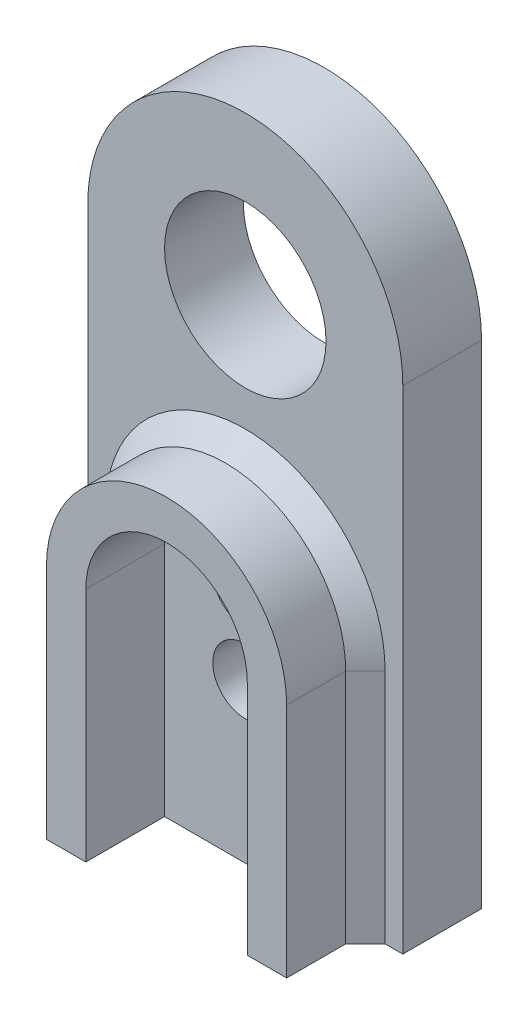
ISO-10303-21;
HEADER;
FILE_DESCRIPTION(('STEP AP214'),'2;1');
FILE_NAME('part.step','',(''),(''),'','','');
FILE_SCHEMA(('AUTOMOTIVE_DESIGN { 1 0 10303 214 1 1 1 1 }'));
ENDSEC;
DATA;
#1=APPLICATION_CONTEXT('core data for automotive mechanical design processes');
#2=APPLICATION_PROTOCOL_DEFINITION('international standard','automotive_design',2000,#1);
#3=PRODUCT_CONTEXT('',#1,'mechanical');
#4=PRODUCT('Part','Part','',(#3));
#5=PRODUCT_RELATED_PRODUCT_CATEGORY('part','',(#4));
#6=PRODUCT_DEFINITION_FORMATION('','',#4);
#7=PRODUCT_DEFINITION_CONTEXT('part definition',#1,'design');
#8=PRODUCT_DEFINITION('design','',#6,#7);
#9=PRODUCT_DEFINITION_SHAPE('','',#8);
#10=(LENGTH_UNIT() NAMED_UNIT(*) SI_UNIT(.MILLI.,.METRE.));
#11=(NAMED_UNIT(*) PLANE_ANGLE_UNIT() SI_UNIT($,.RADIAN.));
#12=(NAMED_UNIT(*) SI_UNIT($,.STERADIAN.) SOLID_ANGLE_UNIT());
#13=UNCERTAINTY_MEASURE_WITH_UNIT(LENGTH_MEASURE(1.E-05),#10,'distance_accuracy_value','');
#14=(GEOMETRIC_REPRESENTATION_CONTEXT(3) GLOBAL_UNCERTAINTY_ASSIGNED_CONTEXT((#13)) GLOBAL_UNIT_ASSIGNED_CONTEXT((#10,
#11,#12)) REPRESENTATION_CONTEXT('',''));
#15=CARTESIAN_POINT('',(0.,0.,0.));
#16=DIRECTION('',(0.,0.,1.));
#17=DIRECTION('',(1.,0.,0.));
#18=AXIS2_PLACEMENT_3D('',#15,#16,#17);
#19=CARTESIAN_POINT('',(0.,0.,4.));
#20=DIRECTION('',(0.,0.,1.));
#21=DIRECTION('',(1.,0.,0.));
#22=AXIS2_PLACEMENT_3D('',#19,#20,#21);
#23=PLANE('',#22);
#24=DIRECTION('',(-1.,0.,0.));
#25=VECTOR('',#24,1.);
#26=CARTESIAN_POINT('',(0.,-25.,4.));
#27=LINE('',#26,#25);
#28=CARTESIAN_POINT('',(-7.1,-25.,4.));
#29=VERTEX_POINT('',#28);
#30=CARTESIAN_POINT('',(-8.,-25.,4.));
#31=VERTEX_POINT('',#30);
#32=EDGE_CURVE('E210',#29,#31,#27,.T.);
#33=ORIENTED_EDGE('',*,*,#32,.F.);
#34=DIRECTION('',(0.,1.,0.));
#35=VECTOR('',#34,1.);
#36=CARTESIAN_POINT('',(-7.1,-13.,4.));
#37=LINE('',#36,#35);
#38=CARTESIAN_POINT('',(-7.1,-13.,4.));
#39=VERTEX_POINT('',#38);
#40=EDGE_CURVE('E249',#29,#39,#37,.T.);
#41=ORIENTED_EDGE('',*,*,#40,.T.);
#42=CARTESIAN_POINT('',(0.,-13.,4.));
#43=DIRECTION('',(0.,0.,1.));
#44=DIRECTION('',(1.,0.,0.));
#45=AXIS2_PLACEMENT_3D('',#42,#43,#44);
#46=CIRCLE('',#45,7.1);
#47=CARTESIAN_POINT('',(7.1,-13.,4.));
#48=VERTEX_POINT('',#47);
#49=EDGE_CURVE('E245',#39,#48,#46,.F.);
#50=ORIENTED_EDGE('',*,*,#49,.T.);
#51=DIRECTION('',(0.,-1.,0.));
#52=VECTOR('',#51,1.);
#53=CARTESIAN_POINT('',(7.1,-25.,4.));
#54=LINE('',#53,#52);
#55=CARTESIAN_POINT('',(7.1,-25.,4.));
#56=VERTEX_POINT('',#55);
#57=EDGE_CURVE('E247',#48,#56,#54,.T.);
#58=ORIENTED_EDGE('',*,*,#57,.T.);
#59=CARTESIAN_POINT('',(8.,-25.,4.));
#60=VERTEX_POINT('',#59);
#61=EDGE_CURVE('E211',#60,#56,#27,.T.);
#62=ORIENTED_EDGE('',*,*,#61,.F.);
#63=DIRECTION('',(0.,1.,0.));
#64=VECTOR('',#63,1.);
#65=CARTESIAN_POINT('',(8.,0.,4.));
#66=LINE('',#65,#64);
#67=CARTESIAN_POINT('',(8.,0.,4.));
#68=VERTEX_POINT('',#67);
#69=EDGE_CURVE('E228',#60,#68,#66,.T.);
#70=ORIENTED_EDGE('',*,*,#69,.T.);
#71=CARTESIAN_POINT('',(0.,0.,4.));
#72=DIRECTION('',(0.,0.,1.));
#73=DIRECTION('',(1.,0.,0.));
#74=AXIS2_PLACEMENT_3D('',#71,#72,#73);
#75=CIRCLE('',#74,8.);
#76=CARTESIAN_POINT('',(-8.,0.,4.));
#77=VERTEX_POINT('',#76);
#78=EDGE_CURVE('E221',#68,#77,#75,.T.);
#79=ORIENTED_EDGE('',*,*,#78,.T.);
#80=DIRECTION('',(0.,-1.,0.));
#81=VECTOR('',#80,1.);
#82=CARTESIAN_POINT('',(-8.,0.,4.));
#83=LINE('',#82,#81);
#84=EDGE_CURVE('E224',#77,#31,#83,.T.);
#85=ORIENTED_EDGE('',*,*,#84,.T.);
#86=EDGE_LOOP('',(#33,#41,#50,#58,#62,#70,#79,#85));
#87=FACE_BOUND('',#86,.T.);
#88=CARTESIAN_POINT('',(0.,0.,4.));
#89=DIRECTION('',(0.,0.,1.));
#90=DIRECTION('',(1.,0.,0.));
#91=AXIS2_PLACEMENT_3D('',#88,#89,#90);
#92=CIRCLE('',#91,4.1);
#93=CARTESIAN_POINT('',(4.1,0.,4.));
#94=VERTEX_POINT('',#93);
#95=EDGE_CURVE('E215',#94,#94,#92,.T.);
#96=ORIENTED_EDGE('',*,*,#95,.F.);
#97=EDGE_LOOP('',(#96));
#98=FACE_BOUND('',#97,.T.);
#99=ADVANCED_FACE('F37',(#87,#98),#23,.T.);
#100=CARTESIAN_POINT('',(0.,-13.0000000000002,4.));
#101=DIRECTION('',(0.,0.,1.));
#102=DIRECTION('',(1.,0.,0.));
#103=AXIS2_PLACEMENT_3D('',#100,#101,#102);
#104=CIRCLE('',#103,1.65);
#105=CARTESIAN_POINT('',(1.65,-13.0000000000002,4.));
#106=VERTEX_POINT('',#105);
#107=EDGE_CURVE('E171',#106,#106,#104,.T.);
#108=ORIENTED_EDGE('',*,*,#107,.F.);
#109=EDGE_LOOP('',(#108));
#110=FACE_BOUND('',#109,.T.);
#111=CARTESIAN_POINT('',(0.,-17.0000000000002,4.));
#112=DIRECTION('',(0.,0.,1.));
#113=DIRECTION('',(1.,0.,0.));
#114=AXIS2_PLACEMENT_3D('',#111,#112,#113);
#115=CIRCLE('',#114,1.65);
#116=CARTESIAN_POINT('',(1.65,-17.0000000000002,4.));
#117=VERTEX_POINT('',#116);
#118=EDGE_CURVE('E274',#117,#117,#115,.T.);
#119=ORIENTED_EDGE('',*,*,#118,.F.);
#120=EDGE_LOOP('',(#119));
#121=FACE_BOUND('',#120,.T.);
#122=CARTESIAN_POINT('',(0.,-13.,4.));
#123=DIRECTION('',(0.,0.,1.));
#124=DIRECTION('',(1.,0.,0.));
#125=AXIS2_PLACEMENT_3D('',#122,#123,#124);
#126=CIRCLE('',#125,4.1);
#127=CARTESIAN_POINT('',(4.1,-13.,4.));
#128=VERTEX_POINT('',#127);
#129=CARTESIAN_POINT('',(-4.1,-13.,4.));
#130=VERTEX_POINT('',#129);
#131=EDGE_CURVE('E188',#128,#130,#126,.T.);
#132=ORIENTED_EDGE('',*,*,#131,.T.);
#133=DIRECTION('',(0.,-1.,0.));
#134=VECTOR('',#133,1.);
#135=CARTESIAN_POINT('',(-4.1,-25.,4.));
#136=LINE('',#135,#134);
#137=CARTESIAN_POINT('',(-4.1,-25.,4.));
#138=VERTEX_POINT('',#137);
#139=EDGE_CURVE('E145',#130,#138,#136,.T.);
#140=ORIENTED_EDGE('',*,*,#139,.T.);
#141=CARTESIAN_POINT('',(4.1,-25.,4.));
#142=VERTEX_POINT('',#141);
#143=EDGE_CURVE('E214',#142,#138,#27,.T.);
#144=ORIENTED_EDGE('',*,*,#143,.F.);
#145=DIRECTION('',(0.,1.,0.));
#146=VECTOR('',#145,1.);
#147=CARTESIAN_POINT('',(4.1,-25.,4.));
#148=LINE('',#147,#146);
#149=EDGE_CURVE('E166',#142,#128,#148,.T.);
#150=ORIENTED_EDGE('',*,*,#149,.T.);
#151=EDGE_LOOP('',(#132,#140,#144,#150));
#152=FACE_BOUND('',#151,.T.);
#153=ADVANCED_FACE('F285',(#110,#121,#152),#23,.T.);
#154=CARTESIAN_POINT('',(0.,0.,0.));
#155=DIRECTION('',(0.,0.,1.));
#156=DIRECTION('',(1.,0.,0.));
#157=AXIS2_PLACEMENT_3D('',#154,#155,#156);
#158=PLANE('',#157);
#159=CARTESIAN_POINT('',(0.,-13.0000000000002,0.));
#160=DIRECTION('',(0.,0.,1.));
#161=DIRECTION('',(1.,0.,0.));
#162=AXIS2_PLACEMENT_3D('',#159,#160,#161);
#163=CIRCLE('',#162,1.65);
#164=CARTESIAN_POINT('',(1.65,-13.0000000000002,0.));
#165=VERTEX_POINT('',#164);
#166=EDGE_CURVE('E269',#165,#165,#163,.T.);
#167=ORIENTED_EDGE('',*,*,#166,.T.);
#168=EDGE_LOOP('',(#167));
#169=FACE_BOUND('',#168,.T.);
#170=CARTESIAN_POINT('',(0.,-17.0000000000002,0.));
#171=DIRECTION('',(0.,0.,1.));
#172=DIRECTION('',(1.,0.,0.));
#173=AXIS2_PLACEMENT_3D('',#170,#171,#172);
#174=CIRCLE('',#173,1.65);
#175=CARTESIAN_POINT('',(1.65,-17.0000000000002,0.));
#176=VERTEX_POINT('',#175);
#177=EDGE_CURVE('E264',#176,#176,#174,.T.);
#178=ORIENTED_EDGE('',*,*,#177,.T.);
#179=EDGE_LOOP('',(#178));
#180=FACE_BOUND('',#179,.T.);
#181=DIRECTION('',(0.,1.,0.));
#182=VECTOR('',#181,1.);
#183=CARTESIAN_POINT('',(8.,0.,0.));
#184=LINE('',#183,#182);
#185=CARTESIAN_POINT('',(8.,-25.,0.));
#186=VERTEX_POINT('',#185);
#187=CARTESIAN_POINT('',(8.,0.,0.));
#188=VERTEX_POINT('',#187);
#189=EDGE_CURVE('E225',#186,#188,#184,.T.);
#190=ORIENTED_EDGE('',*,*,#189,.F.);
#191=DIRECTION('',(1.,0.,0.));
#192=VECTOR('',#191,1.);
#193=CARTESIAN_POINT('',(8.,-25.,0.));
#194=LINE('',#193,#192);
#195=CARTESIAN_POINT('',(-8.,-25.,0.));
#196=VERTEX_POINT('',#195);
#197=EDGE_CURVE('E192',#196,#186,#194,.T.);
#198=ORIENTED_EDGE('',*,*,#197,.F.);
#199=DIRECTION('',(0.,-1.,0.));
#200=VECTOR('',#199,1.);
#201=CARTESIAN_POINT('',(-8.,0.,0.));
#202=LINE('',#201,#200);
#203=CARTESIAN_POINT('',(-8.,0.,0.));
#204=VERTEX_POINT('',#203);
#205=EDGE_CURVE('E233',#204,#196,#202,.T.);
#206=ORIENTED_EDGE('',*,*,#205,.F.);
#207=CARTESIAN_POINT('',(0.,0.,0.));
#208=DIRECTION('',(0.,0.,1.));
#209=DIRECTION('',(1.,0.,0.));
#210=AXIS2_PLACEMENT_3D('',#207,#208,#209);
#211=CIRCLE('',#210,8.);
#212=EDGE_CURVE('E218',#188,#204,#211,.T.);
#213=ORIENTED_EDGE('',*,*,#212,.F.);
#214=EDGE_LOOP('',(#190,#198,#206,#213));
#215=FACE_BOUND('',#214,.T.);
#216=CARTESIAN_POINT('',(0.,0.,0.));
#217=DIRECTION('',(0.,0.,1.));
#218=DIRECTION('',(1.,0.,0.));
#219=AXIS2_PLACEMENT_3D('',#216,#217,#218);
#220=CIRCLE('',#219,4.1);
#221=CARTESIAN_POINT('',(4.1,0.,0.));
#222=VERTEX_POINT('',#221);
#223=EDGE_CURVE('E213',#222,#222,#220,.T.);
#224=ORIENTED_EDGE('',*,*,#223,.T.);
#225=EDGE_LOOP('',(#224));
#226=FACE_BOUND('',#225,.T.);
#227=ADVANCED_FACE('F288',(#169,#180,#215,#226),#158,.F.);
#228=CARTESIAN_POINT('',(0.,0.,4.));
#229=DIRECTION('',(0.,0.,-1.));
#230=DIRECTION('',(-1.,0.,0.));
#231=AXIS2_PLACEMENT_3D('',#228,#229,#230);
#232=CYLINDRICAL_SURFACE('',#231,8.);
#233=ORIENTED_EDGE('',*,*,#212,.T.);
#234=DIRECTION('',(0.,0.,-1.));
#235=VECTOR('',#234,1.);
#236=CARTESIAN_POINT('',(-8.,0.,4.));
#237=LINE('',#236,#235);
#238=EDGE_CURVE('E239',#77,#204,#237,.T.);
#239=ORIENTED_EDGE('',*,*,#238,.F.);
#240=ORIENTED_EDGE('',*,*,#78,.F.);
#241=DIRECTION('',(0.,0.,-1.));
#242=VECTOR('',#241,1.);
#243=CARTESIAN_POINT('',(8.,0.,4.));
#244=LINE('',#243,#242);
#245=EDGE_CURVE('E230',#68,#188,#244,.T.);
#246=ORIENTED_EDGE('',*,*,#245,.T.);
#247=EDGE_LOOP('',(#233,#239,#240,#246));
#248=FACE_BOUND('',#247,.T.);
#249=ADVANCED_FACE('F330',(#248),#232,.T.);
#250=CARTESIAN_POINT('',(-8.,0.,4.));
#251=DIRECTION('',(1.,0.,0.));
#252=DIRECTION('',(0.,1.,0.));
#253=AXIS2_PLACEMENT_3D('',#250,#251,#252);
#254=PLANE('',#253);
#255=ORIENTED_EDGE('',*,*,#205,.T.);
#256=DIRECTION('',(0.,0.,1.));
#257=VECTOR('',#256,1.);
#258=CARTESIAN_POINT('',(-8.,-25.,4.));
#259=LINE('',#258,#257);
#260=EDGE_CURVE('E207',#196,#31,#259,.T.);
#261=ORIENTED_EDGE('',*,*,#260,.T.);
#262=ORIENTED_EDGE('',*,*,#84,.F.);
#263=ORIENTED_EDGE('',*,*,#238,.T.);
#264=EDGE_LOOP('',(#255,#261,#262,#263));
#265=FACE_BOUND('',#264,.T.);
#266=ADVANCED_FACE('F335',(#265),#254,.F.);
#267=CARTESIAN_POINT('',(8.,0.,4.));
#268=DIRECTION('',(-1.,0.,0.));
#269=DIRECTION('',(0.,-1.,0.));
#270=AXIS2_PLACEMENT_3D('',#267,#268,#269);
#271=PLANE('',#270);
#272=ORIENTED_EDGE('',*,*,#69,.F.);
#273=DIRECTION('',(0.,0.,-1.));
#274=VECTOR('',#273,1.);
#275=CARTESIAN_POINT('',(8.,-25.,4.));
#276=LINE('',#275,#274);
#277=EDGE_CURVE('E242',#60,#186,#276,.T.);
#278=ORIENTED_EDGE('',*,*,#277,.T.);
#279=ORIENTED_EDGE('',*,*,#189,.T.);
#280=ORIENTED_EDGE('',*,*,#245,.F.);
#281=EDGE_LOOP('',(#272,#278,#279,#280));
#282=FACE_BOUND('',#281,.T.);
#283=ADVANCED_FACE('F332',(#282),#271,.F.);
#284=CARTESIAN_POINT('',(0.,0.,4.));
#285=DIRECTION('',(0.,0.,-1.));
#286=DIRECTION('',(-1.,0.,0.));
#287=AXIS2_PLACEMENT_3D('',#284,#285,#286);
#288=CYLINDRICAL_SURFACE('',#287,4.1);
#289=ORIENTED_EDGE('',*,*,#95,.T.);
#290=EDGE_LOOP('',(#289));
#291=FACE_BOUND('',#290,.T.);
#292=ORIENTED_EDGE('',*,*,#223,.F.);
#293=EDGE_LOOP('',(#292));
#294=FACE_BOUND('',#293,.T.);
#295=ADVANCED_FACE('F326',(#291,#294),#288,.F.);
#296=CARTESIAN_POINT('',(8.,-25.,10.));
#297=DIRECTION('',(0.,1.,0.));
#298=DIRECTION('',(0.,0.,1.));
#299=AXIS2_PLACEMENT_3D('',#296,#297,#298);
#300=PLANE('',#299);
#301=ORIENTED_EDGE('',*,*,#61,.T.);
#302=DIRECTION('',(0.707106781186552,0.,-0.707106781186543));
#303=VECTOR('',#302,1.);
#304=CARTESIAN_POINT('',(4.55000000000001,-25.,6.54999999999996));
#305=LINE('',#304,#303);
#306=CARTESIAN_POINT('',(6.1,-25.,4.99999999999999));
#307=VERTEX_POINT('',#306);
#308=EDGE_CURVE('E11',#56,#307,#305,.F.);
#309=ORIENTED_EDGE('',*,*,#308,.T.);
#310=DIRECTION('',(0.,0.,-1.));
#311=VECTOR('',#310,1.);
#312=CARTESIAN_POINT('',(6.1,-25.,8.));
#313=LINE('',#312,#311);
#314=CARTESIAN_POINT('',(6.1,-25.,8.));
#315=VERTEX_POINT('',#314);
#316=EDGE_CURVE('E195',#315,#307,#313,.T.);
#317=ORIENTED_EDGE('',*,*,#316,.F.);
#318=DIRECTION('',(-1.,0.,0.));
#319=VECTOR('',#318,1.);
#320=CARTESIAN_POINT('',(4.1,-25.,8.));
#321=LINE('',#320,#319);
#322=CARTESIAN_POINT('',(4.1,-25.,8.));
#323=VERTEX_POINT('',#322);
#324=EDGE_CURVE('E184',#315,#323,#321,.T.);
#325=ORIENTED_EDGE('',*,*,#324,.T.);
#326=DIRECTION('',(0.,0.,-1.));
#327=VECTOR('',#326,1.);
#328=CARTESIAN_POINT('',(4.1,-25.,8.));
#329=LINE('',#328,#327);
#330=EDGE_CURVE('E193',#323,#142,#329,.T.);
#331=ORIENTED_EDGE('',*,*,#330,.T.);
#332=ORIENTED_EDGE('',*,*,#143,.T.);
#333=DIRECTION('',(0.,0.,-1.));
#334=VECTOR('',#333,1.);
#335=CARTESIAN_POINT('',(-4.1,-25.,8.));
#336=LINE('',#335,#334);
#337=CARTESIAN_POINT('',(-4.1,-25.,8.));
#338=VERTEX_POINT('',#337);
#339=EDGE_CURVE('E149',#338,#138,#336,.T.);
#340=ORIENTED_EDGE('',*,*,#339,.F.);
#341=DIRECTION('',(-1.,0.,0.));
#342=VECTOR('',#341,1.);
#343=CARTESIAN_POINT('',(-6.1,-25.,8.));
#344=LINE('',#343,#342);
#345=CARTESIAN_POINT('',(-6.1,-25.,8.));
#346=VERTEX_POINT('',#345);
#347=EDGE_CURVE('E161',#338,#346,#344,.T.);
#348=ORIENTED_EDGE('',*,*,#347,.T.);
#349=DIRECTION('',(0.,0.,-1.));
#350=VECTOR('',#349,1.);
#351=CARTESIAN_POINT('',(-6.1,-25.,8.));
#352=LINE('',#351,#350);
#353=CARTESIAN_POINT('',(-6.1,-25.,4.99999999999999));
#354=VERTEX_POINT('',#353);
#355=EDGE_CURVE('E202',#346,#354,#352,.T.);
#356=ORIENTED_EDGE('',*,*,#355,.T.);
#357=DIRECTION('',(0.707106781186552,0.,0.707106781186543));
#358=VECTOR('',#357,1.);
#359=CARTESIAN_POINT('',(3.45000000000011,-25.,14.55));
#360=LINE('',#359,#358);
#361=EDGE_CURVE('E47',#354,#29,#360,.F.);
#362=ORIENTED_EDGE('',*,*,#361,.T.);
#363=ORIENTED_EDGE('',*,*,#32,.T.);
#364=ORIENTED_EDGE('',*,*,#260,.F.);
#365=ORIENTED_EDGE('',*,*,#197,.T.);
#366=ORIENTED_EDGE('',*,*,#277,.F.);
#367=EDGE_LOOP('',(#301,#309,#317,#325,#331,#332,#340,#348,#356,#362,#363,#364,#365,#366));
#368=FACE_BOUND('',#367,.T.);
#369=ADVANCED_FACE('F310',(#368),#300,.F.);
#370=CARTESIAN_POINT('',(0.,-13.,8.));
#371=DIRECTION('',(0.,0.,-1.));
#372=DIRECTION('',(-1.,0.,0.));
#373=AXIS2_PLACEMENT_3D('',#370,#371,#372);
#374=CYLINDRICAL_SURFACE('',#373,4.1);
#375=ORIENTED_EDGE('',*,*,#131,.F.);
#376=DIRECTION('',(0.,0.,-1.));
#377=VECTOR('',#376,1.);
#378=CARTESIAN_POINT('',(4.1,-13.,8.));
#379=LINE('',#378,#377);
#380=CARTESIAN_POINT('',(4.1,-13.,8.));
#381=VERTEX_POINT('',#380);
#382=EDGE_CURVE('E165',#381,#128,#379,.T.);
#383=ORIENTED_EDGE('',*,*,#382,.F.);
#384=CARTESIAN_POINT('',(0.,-13.,8.));
#385=DIRECTION('',(0.,0.,1.));
#386=DIRECTION('',(1.,0.,0.));
#387=AXIS2_PLACEMENT_3D('',#384,#385,#386);
#388=CIRCLE('',#387,4.1);
#389=CARTESIAN_POINT('',(-4.1,-13.,8.));
#390=VERTEX_POINT('',#389);
#391=EDGE_CURVE('E157',#381,#390,#388,.T.);
#392=ORIENTED_EDGE('',*,*,#391,.T.);
#393=DIRECTION('',(0.,0.,-1.));
#394=VECTOR('',#393,1.);
#395=CARTESIAN_POINT('',(-4.1,-13.,8.));
#396=LINE('',#395,#394);
#397=EDGE_CURVE('E140',#390,#130,#396,.T.);
#398=ORIENTED_EDGE('',*,*,#397,.T.);
#399=EDGE_LOOP('',(#375,#383,#392,#398));
#400=FACE_BOUND('',#399,.T.);
#401=ADVANCED_FACE('F163',(#400),#374,.F.);
#402=CARTESIAN_POINT('',(4.1,-25.,8.));
#403=DIRECTION('',(-1.,0.,0.));
#404=DIRECTION('',(0.,0.,1.));
#405=AXIS2_PLACEMENT_3D('',#402,#403,#404);
#406=PLANE('',#405);
#407=ORIENTED_EDGE('',*,*,#149,.F.);
#408=ORIENTED_EDGE('',*,*,#330,.F.);
#409=DIRECTION('',(0.,1.,0.));
#410=VECTOR('',#409,1.);
#411=CARTESIAN_POINT('',(4.1,-25.,8.));
#412=LINE('',#411,#410);
#413=EDGE_CURVE('E150',#323,#381,#412,.T.);
#414=ORIENTED_EDGE('',*,*,#413,.T.);
#415=ORIENTED_EDGE('',*,*,#382,.T.);
#416=EDGE_LOOP('',(#407,#408,#414,#415));
#417=FACE_BOUND('',#416,.T.);
#418=ADVANCED_FACE('F295',(#417),#406,.T.);
#419=CARTESIAN_POINT('',(6.1,-25.,8.));
#420=DIRECTION('',(1.,0.,0.));
#421=DIRECTION('',(0.,0.,-1.));
#422=AXIS2_PLACEMENT_3D('',#419,#420,#421);
#423=PLANE('',#422);
#424=ORIENTED_EDGE('',*,*,#316,.T.);
#425=DIRECTION('',(0.,1.,0.));
#426=VECTOR('',#425,1.);
#427=CARTESIAN_POINT('',(6.1,-13.,4.99999999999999));
#428=LINE('',#427,#426);
#429=CARTESIAN_POINT('',(6.1,-13.,4.99999999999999));
#430=VERTEX_POINT('',#429);
#431=EDGE_CURVE('E60',#307,#430,#428,.T.);
#432=ORIENTED_EDGE('',*,*,#431,.T.);
#433=DIRECTION('',(0.,0.,-1.));
#434=VECTOR('',#433,1.);
#435=CARTESIAN_POINT('',(6.1,-13.,8.));
#436=LINE('',#435,#434);
#437=CARTESIAN_POINT('',(6.1,-13.,8.));
#438=VERTEX_POINT('',#437);
#439=EDGE_CURVE('E197',#438,#430,#436,.T.);
#440=ORIENTED_EDGE('',*,*,#439,.F.);
#441=DIRECTION('',(0.,-1.,0.));
#442=VECTOR('',#441,1.);
#443=CARTESIAN_POINT('',(6.1,-25.,8.));
#444=LINE('',#443,#442);
#445=EDGE_CURVE('E181',#438,#315,#444,.T.);
#446=ORIENTED_EDGE('',*,*,#445,.T.);
#447=EDGE_LOOP('',(#424,#432,#440,#446));
#448=FACE_BOUND('',#447,.T.);
#449=ADVANCED_FACE('F299',(#448),#423,.T.);
#450=CARTESIAN_POINT('',(0.,-13.,8.));
#451=DIRECTION('',(0.,0.,-1.));
#452=DIRECTION('',(-1.,0.,0.));
#453=AXIS2_PLACEMENT_3D('',#450,#451,#452);
#454=CYLINDRICAL_SURFACE('',#453,6.1);
#455=ORIENTED_EDGE('',*,*,#439,.T.);
#456=CARTESIAN_POINT('',(0.,-13.,4.99999999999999));
#457=DIRECTION('',(0.,0.,1.));
#458=DIRECTION('',(1.,0.,0.));
#459=AXIS2_PLACEMENT_3D('',#456,#457,#458);
#460=CIRCLE('',#459,6.1);
#461=CARTESIAN_POINT('',(-6.1,-13.,4.99999999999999));
#462=VERTEX_POINT('',#461);
#463=EDGE_CURVE('E255',#430,#462,#460,.T.);
#464=ORIENTED_EDGE('',*,*,#463,.T.);
#465=DIRECTION('',(0.,0.,-1.));
#466=VECTOR('',#465,1.);
#467=CARTESIAN_POINT('',(-6.1,-13.,8.));
#468=LINE('',#467,#466);
#469=CARTESIAN_POINT('',(-6.1,-13.,8.));
#470=VERTEX_POINT('',#469);
#471=EDGE_CURVE('E199',#470,#462,#468,.T.);
#472=ORIENTED_EDGE('',*,*,#471,.F.);
#473=CARTESIAN_POINT('',(0.,-13.,8.));
#474=DIRECTION('',(0.,0.,-1.));
#475=DIRECTION('',(1.,0.,0.));
#476=AXIS2_PLACEMENT_3D('',#473,#474,#475);
#477=CIRCLE('',#476,6.1);
#478=EDGE_CURVE('E178',#470,#438,#477,.T.);
#479=ORIENTED_EDGE('',*,*,#478,.T.);
#480=EDGE_LOOP('',(#455,#464,#472,#479));
#481=FACE_BOUND('',#480,.T.);
#482=ADVANCED_FACE('F301',(#481),#454,.T.);
#483=CARTESIAN_POINT('',(-6.1,-25.,8.));
#484=DIRECTION('',(-1.,0.,0.));
#485=DIRECTION('',(0.,0.,1.));
#486=AXIS2_PLACEMENT_3D('',#483,#484,#485);
#487=PLANE('',#486);
#488=ORIENTED_EDGE('',*,*,#471,.T.);
#489=DIRECTION('',(0.,-1.,0.));
#490=VECTOR('',#489,1.);
#491=CARTESIAN_POINT('',(-6.1,-25.,4.99999999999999));
#492=LINE('',#491,#490);
#493=EDGE_CURVE('E252',#462,#354,#492,.T.);
#494=ORIENTED_EDGE('',*,*,#493,.T.);
#495=ORIENTED_EDGE('',*,*,#355,.F.);
#496=DIRECTION('',(0.,1.,0.));
#497=VECTOR('',#496,1.);
#498=CARTESIAN_POINT('',(-6.1,-25.,8.));
#499=LINE('',#498,#497);
#500=EDGE_CURVE('E175',#346,#470,#499,.T.);
#501=ORIENTED_EDGE('',*,*,#500,.T.);
#502=EDGE_LOOP('',(#488,#494,#495,#501));
#503=FACE_BOUND('',#502,.T.);
#504=ADVANCED_FACE('F312',(#503),#487,.T.);
#505=CARTESIAN_POINT('',(-4.1,-25.,8.));
#506=DIRECTION('',(1.,0.,0.));
#507=DIRECTION('',(0.,0.,-1.));
#508=AXIS2_PLACEMENT_3D('',#505,#506,#507);
#509=PLANE('',#508);
#510=ORIENTED_EDGE('',*,*,#139,.F.);
#511=ORIENTED_EDGE('',*,*,#397,.F.);
#512=DIRECTION('',(0.,-1.,0.));
#513=VECTOR('',#512,1.);
#514=CARTESIAN_POINT('',(-4.1,-25.,8.));
#515=LINE('',#514,#513);
#516=EDGE_CURVE('E143',#390,#338,#515,.T.);
#517=ORIENTED_EDGE('',*,*,#516,.T.);
#518=ORIENTED_EDGE('',*,*,#339,.T.);
#519=EDGE_LOOP('',(#510,#511,#517,#518));
#520=FACE_BOUND('',#519,.T.);
#521=ADVANCED_FACE('F142',(#520),#509,.T.);
#522=CARTESIAN_POINT('',(0.,-13.,8.));
#523=DIRECTION('',(0.,0.,1.));
#524=DIRECTION('',(1.,0.,0.));
#525=AXIS2_PLACEMENT_3D('',#522,#523,#524);
#526=PLANE('',#525);
#527=ORIENTED_EDGE('',*,*,#391,.F.);
#528=ORIENTED_EDGE('',*,*,#413,.F.);
#529=ORIENTED_EDGE('',*,*,#324,.F.);
#530=ORIENTED_EDGE('',*,*,#445,.F.);
#531=ORIENTED_EDGE('',*,*,#478,.F.);
#532=ORIENTED_EDGE('',*,*,#500,.F.);
#533=ORIENTED_EDGE('',*,*,#347,.F.);
#534=ORIENTED_EDGE('',*,*,#516,.F.);
#535=EDGE_LOOP('',(#527,#528,#529,#530,#531,#532,#533,#534));
#536=FACE_BOUND('',#535,.T.);
#537=ADVANCED_FACE('F155',(#536),#526,.T.);
#538=CARTESIAN_POINT('',(0.,-17.0000000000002,0.));
#539=DIRECTION('',(0.,0.,1.));
#540=DIRECTION('',(1.,0.,0.));
#541=AXIS2_PLACEMENT_3D('',#538,#539,#540);
#542=CYLINDRICAL_SURFACE('',#541,1.65);
#543=ORIENTED_EDGE('',*,*,#118,.T.);
#544=EDGE_LOOP('',(#543));
#545=FACE_BOUND('',#544,.T.);
#546=ORIENTED_EDGE('',*,*,#177,.F.);
#547=EDGE_LOOP('',(#546));
#548=FACE_BOUND('',#547,.T.);
#549=ADVANCED_FACE('F357',(#545,#548),#542,.F.);
#550=CARTESIAN_POINT('',(0.,-13.0000000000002,0.));
#551=DIRECTION('',(0.,0.,1.));
#552=DIRECTION('',(1.,0.,0.));
#553=AXIS2_PLACEMENT_3D('',#550,#551,#552);
#554=CYLINDRICAL_SURFACE('',#553,1.65);
#555=ORIENTED_EDGE('',*,*,#107,.T.);
#556=EDGE_LOOP('',(#555));
#557=FACE_BOUND('',#556,.T.);
#558=ORIENTED_EDGE('',*,*,#166,.F.);
#559=EDGE_LOOP('',(#558));
#560=FACE_BOUND('',#559,.T.);
#561=ADVANCED_FACE('F282',(#557,#560),#554,.F.);
#562=CARTESIAN_POINT('',(7.1,0.,4.));
#563=DIRECTION('',(0.707106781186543,0.,0.707106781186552));
#564=DIRECTION('',(0.,1.,0.));
#565=AXIS2_PLACEMENT_3D('',#562,#563,#564);
#566=PLANE('',#565);
#567=ORIENTED_EDGE('',*,*,#308,.F.);
#568=ORIENTED_EDGE('',*,*,#57,.F.);
#569=DIRECTION('',(0.707106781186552,0.,-0.707106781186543));
#570=VECTOR('',#569,1.);
#571=CARTESIAN_POINT('',(6.1,-13.,4.99999999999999));
#572=LINE('',#571,#570);
#573=EDGE_CURVE('E42',#430,#48,#572,.T.);
#574=ORIENTED_EDGE('',*,*,#573,.F.);
#575=ORIENTED_EDGE('',*,*,#431,.F.);
#576=EDGE_LOOP('',(#567,#568,#574,#575));
#577=FACE_BOUND('',#576,.T.);
#578=ADVANCED_FACE('F40',(#577),#566,.T.);
#579=CARTESIAN_POINT('',(0.,-13.,4.));
#580=DIRECTION('',(0.,0.,-1.));
#581=DIRECTION('',(-1.,0.,0.));
#582=AXIS2_PLACEMENT_3D('',#579,#580,#581);
#583=CONICAL_SURFACE('',#582,7.1,0.785398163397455);
#584=ORIENTED_EDGE('',*,*,#573,.T.);
#585=ORIENTED_EDGE('',*,*,#49,.F.);
#586=DIRECTION('',(-0.707106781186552,0.,-0.707106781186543));
#587=VECTOR('',#586,1.);
#588=CARTESIAN_POINT('',(-6.1,-13.,4.99999999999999));
#589=LINE('',#588,#587);
#590=EDGE_CURVE('E257',#462,#39,#589,.T.);
#591=ORIENTED_EDGE('',*,*,#590,.F.);
#592=ORIENTED_EDGE('',*,*,#463,.F.);
#593=EDGE_LOOP('',(#584,#585,#591,#592));
#594=FACE_BOUND('',#593,.T.);
#595=ADVANCED_FACE('F304',(#594),#583,.T.);
#596=CARTESIAN_POINT('',(-7.1,0.,4.));
#597=DIRECTION('',(-0.707106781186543,0.,0.707106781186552));
#598=DIRECTION('',(0.,-1.,0.));
#599=AXIS2_PLACEMENT_3D('',#596,#597,#598);
#600=PLANE('',#599);
#601=ORIENTED_EDGE('',*,*,#361,.F.);
#602=ORIENTED_EDGE('',*,*,#493,.F.);
#603=ORIENTED_EDGE('',*,*,#590,.T.);
#604=ORIENTED_EDGE('',*,*,#40,.F.);
#605=EDGE_LOOP('',(#601,#602,#603,#604));
#606=FACE_BOUND('',#605,.T.);
#607=ADVANCED_FACE('F309',(#606),#600,.T.);
#608=CLOSED_SHELL('',(#99,#153,#227,#249,#266,#283,#295,#369,#401,#418,#449,#482,#504,#521,#537,
#549,#561,#578,#595,#607));
#609=MANIFOLD_SOLID_BREP('B2',#608);
#610=ADVANCED_BREP_SHAPE_REPRESENTATION('',(#18,#609),#14);
#611=SHAPE_DEFINITION_REPRESENTATION(#9,#610);
ENDSEC;
END-ISO-10303-21;
